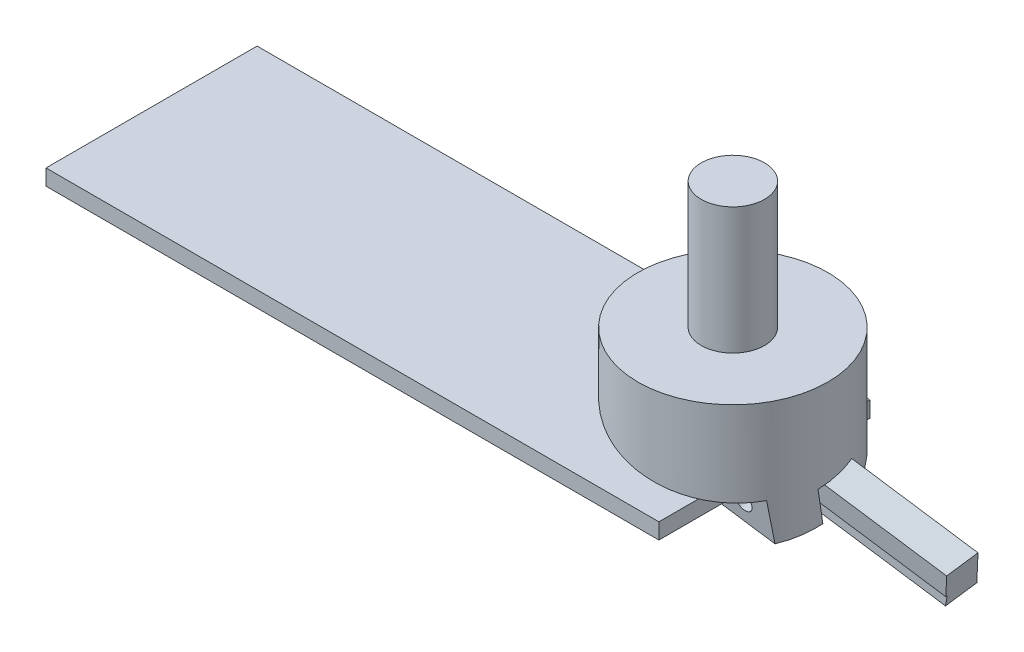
ISO-10303-21;
HEADER;
FILE_DESCRIPTION(('STEP AP214'),'2;1');
FILE_NAME('part.step','',(''),(''),'','','');
FILE_SCHEMA(('AUTOMOTIVE_DESIGN { 1 0 10303 214 1 1 1 1 }'));
ENDSEC;
DATA;
#1=APPLICATION_CONTEXT('core data for automotive mechanical design processes');
#2=APPLICATION_PROTOCOL_DEFINITION('international standard','automotive_design',2000,#1);
#3=PRODUCT_CONTEXT('',#1,'mechanical');
#4=PRODUCT('Part','Part','',(#3));
#5=PRODUCT_RELATED_PRODUCT_CATEGORY('part','',(#4));
#6=PRODUCT_DEFINITION_FORMATION('','',#4);
#7=PRODUCT_DEFINITION_CONTEXT('part definition',#1,'design');
#8=PRODUCT_DEFINITION('design','',#6,#7);
#9=PRODUCT_DEFINITION_SHAPE('','',#8);
#10=(LENGTH_UNIT() NAMED_UNIT(*) SI_UNIT(.MILLI.,.METRE.));
#11=(NAMED_UNIT(*) PLANE_ANGLE_UNIT() SI_UNIT($,.RADIAN.));
#12=(NAMED_UNIT(*) SI_UNIT($,.STERADIAN.) SOLID_ANGLE_UNIT());
#13=UNCERTAINTY_MEASURE_WITH_UNIT(LENGTH_MEASURE(1.E-05),#10,'distance_accuracy_value','');
#14=(GEOMETRIC_REPRESENTATION_CONTEXT(3) GLOBAL_UNCERTAINTY_ASSIGNED_CONTEXT((#13)) GLOBAL_UNIT_ASSIGNED_CONTEXT((#10,
#11,#12)) REPRESENTATION_CONTEXT('',''));
#15=CARTESIAN_POINT('',(0.,0.,0.));
#16=DIRECTION('',(0.,0.,1.));
#17=DIRECTION('',(1.,0.,0.));
#18=AXIS2_PLACEMENT_3D('',#15,#16,#17);
#19=CARTESIAN_POINT('',(67.583925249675,-12.8358584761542,-9.85090724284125));
#20=DIRECTION('',(0.173648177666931,0.975223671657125,0.137058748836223));
#21=DIRECTION('',(-0.984514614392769,0.175302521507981,0.));
#22=AXIS2_PLACEMENT_3D('',#19,#20,#21);
#23=PLANE('',#22);
#24=DIRECTION('',(-0.984807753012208,0.171958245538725,0.0241671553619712));
#25=VECTOR('',#24,1.);
#26=CARTESIAN_POINT('',(67.583925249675,-12.8358584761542,-9.85090724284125));
#27=LINE('',#26,#25);
#28=CARTESIAN_POINT('',(67.583925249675,-12.8358584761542,-9.85090724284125));
#29=VERTEX_POINT('',#28);
#30=CARTESIAN_POINT('',(-30.8968500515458,4.35996607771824,-7.43419170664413));
#31=VERTEX_POINT('',#30);
#32=EDGE_CURVE('E59',#29,#31,#27,.T.);
#33=ORIENTED_EDGE('',*,*,#32,.T.);
#34=DIRECTION('',(0.,0.139173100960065,-0.99026806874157));
#35=VECTOR('',#34,1.);
#36=CARTESIAN_POINT('',(-30.8968500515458,4.35996607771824,-7.43419170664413));
#37=LINE('',#36,#35);
#38=CARTESIAN_POINT('',(-30.8968500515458,2.96823506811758,2.46848898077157));
#39=VERTEX_POINT('',#38);
#40=EDGE_CURVE('E108',#39,#31,#37,.T.);
#41=ORIENTED_EDGE('',*,*,#40,.F.);
#42=DIRECTION('',(-0.984807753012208,0.171958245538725,0.0241671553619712));
#43=VECTOR('',#42,1.);
#44=CARTESIAN_POINT('',(67.583925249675,-14.2275894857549,0.0517734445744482));
#45=LINE('',#44,#43);
#46=CARTESIAN_POINT('',(67.583925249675,-14.2275894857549,0.0517734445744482));
#47=VERTEX_POINT('',#46);
#48=EDGE_CURVE('E12',#47,#39,#45,.T.);
#49=ORIENTED_EDGE('',*,*,#48,.F.);
#50=DIRECTION('',(0.,0.139173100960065,-0.99026806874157));
#51=VECTOR('',#50,1.);
#52=CARTESIAN_POINT('',(67.583925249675,-12.8358584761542,-9.85090724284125));
#53=LINE('',#52,#51);
#54=EDGE_CURVE('E109',#47,#29,#53,.T.);
#55=ORIENTED_EDGE('',*,*,#54,.T.);
#56=EDGE_LOOP('',(#33,#41,#49,#55));
#57=FACE_BOUND('',#56,.T.);
#58=ADVANCED_FACE('F56',(#57),#23,.T.);
#59=CARTESIAN_POINT('',(66.3786775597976,-20.9963681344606,-0.899516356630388));
#60=DIRECTION('',(0.,-0.139173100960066,0.99026806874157));
#61=DIRECTION('',(0.,-0.99026806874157,-0.139173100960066));
#62=AXIS2_PLACEMENT_3D('',#59,#60,#61);
#63=PLANE('',#62);
#64=ORIENTED_EDGE('',*,*,#48,.T.);
#65=DIRECTION('',(0.173648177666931,0.975223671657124,0.137058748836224));
#66=VECTOR('',#65,1.);
#67=CARTESIAN_POINT('',(-32.1020977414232,-3.80054358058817,1.51719917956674));
#68=LINE('',#67,#66);
#69=CARTESIAN_POINT('',(-32.1020977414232,-3.80054358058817,1.51719917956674));
#70=VERTEX_POINT('',#69);
#71=EDGE_CURVE('E126',#70,#39,#68,.T.);
#72=ORIENTED_EDGE('',*,*,#71,.F.);
#73=DIRECTION('',(-0.984807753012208,0.171958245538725,0.0241671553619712));
#74=VECTOR('',#73,1.);
#75=CARTESIAN_POINT('',(66.3786775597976,-20.9963681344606,-0.899516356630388));
#76=LINE('',#75,#74);
#77=CARTESIAN_POINT('',(66.3786775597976,-20.9963681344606,-0.899516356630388));
#78=VERTEX_POINT('',#77);
#79=EDGE_CURVE('E64',#78,#70,#76,.T.);
#80=ORIENTED_EDGE('',*,*,#79,.F.);
#81=DIRECTION('',(0.173648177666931,0.975223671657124,0.137058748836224));
#82=VECTOR('',#81,1.);
#83=CARTESIAN_POINT('',(66.3786775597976,-20.9963681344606,-0.899516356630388));
#84=LINE('',#83,#82);
#85=EDGE_CURVE('E114',#78,#47,#84,.T.);
#86=ORIENTED_EDGE('',*,*,#85,.T.);
#87=EDGE_LOOP('',(#64,#72,#80,#86));
#88=FACE_BOUND('',#87,.T.);
#89=ADVANCED_FACE('F166',(#88),#63,.T.);
#90=CARTESIAN_POINT('',(66.3683880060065,-20.9954766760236,-1.32515710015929));
#91=DIRECTION('',(-0.171958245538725,-0.985102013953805,0.00209377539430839));
#92=DIRECTION('',(0.985104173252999,-0.171958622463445,0.));
#93=AXIS2_PLACEMENT_3D('',#90,#91,#92);
#94=PLANE('',#93);
#95=ORIENTED_EDGE('',*,*,#79,.T.);
#96=DIRECTION('',(0.0241671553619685,-0.00209377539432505,0.999705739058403));
#97=VECTOR('',#96,1.);
#98=CARTESIAN_POINT('',(-32.1123872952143,-3.79965212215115,1.09155843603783));
#99=LINE('',#98,#97);
#100=CARTESIAN_POINT('',(-32.1123872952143,-3.79965212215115,1.09155843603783));
#101=VERTEX_POINT('',#100);
#102=EDGE_CURVE('E133',#101,#70,#99,.T.);
#103=ORIENTED_EDGE('',*,*,#102,.F.);
#104=DIRECTION('',(-0.984807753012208,0.171958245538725,0.0241671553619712));
#105=VECTOR('',#104,1.);
#106=CARTESIAN_POINT('',(66.3683880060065,-20.9954766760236,-1.32515710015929));
#107=LINE('',#106,#105);
#108=CARTESIAN_POINT('',(66.3683880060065,-20.9954766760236,-1.32515710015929));
#109=VERTEX_POINT('',#108);
#110=EDGE_CURVE('E149',#109,#101,#107,.T.);
#111=ORIENTED_EDGE('',*,*,#110,.F.);
#112=DIRECTION('',(0.0241671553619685,-0.00209377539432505,0.999705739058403));
#113=VECTOR('',#112,1.);
#114=CARTESIAN_POINT('',(66.3683880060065,-20.9954766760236,-1.32515710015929));
#115=LINE('',#114,#113);
#116=EDGE_CURVE('E145',#109,#78,#115,.T.);
#117=ORIENTED_EDGE('',*,*,#116,.T.);
#118=EDGE_LOOP('',(#95,#103,#111,#117));
#119=FACE_BOUND('',#118,.T.);
#120=ADVANCED_FACE('F162',(#119),#94,.T.);
#121=CARTESIAN_POINT('',(65.8474434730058,-23.9798262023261,-1.31881404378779));
#122=DIRECTION('',(0.0241671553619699,-0.00209377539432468,0.999705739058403));
#123=DIRECTION('',(0.999707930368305,0.,-0.0241672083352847));
#124=AXIS2_PLACEMENT_3D('',#121,#122,#123);
#125=PLANE('',#124);
#126=ORIENTED_EDGE('',*,*,#110,.T.);
#127=DIRECTION('',(0.171958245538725,0.985102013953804,-0.00209377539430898));
#128=VECTOR('',#127,1.);
#129=CARTESIAN_POINT('',(-32.6333318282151,-6.78400164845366,1.09790149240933));
#130=LINE('',#129,#128);
#131=CARTESIAN_POINT('',(-32.6333318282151,-6.78400164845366,1.09790149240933));
#132=VERTEX_POINT('',#131);
#133=EDGE_CURVE('E130',#132,#101,#130,.T.);
#134=ORIENTED_EDGE('',*,*,#133,.F.);
#135=DIRECTION('',(-0.984807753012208,0.171958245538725,0.0241671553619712));
#136=VECTOR('',#135,1.);
#137=CARTESIAN_POINT('',(65.8474434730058,-23.9798262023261,-1.31881404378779));
#138=LINE('',#137,#136);
#139=CARTESIAN_POINT('',(65.8474434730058,-23.9798262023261,-1.31881404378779));
#140=VERTEX_POINT('',#139);
#141=EDGE_CURVE('E151',#140,#132,#138,.T.);
#142=ORIENTED_EDGE('',*,*,#141,.F.);
#143=DIRECTION('',(0.171958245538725,0.985102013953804,-0.00209377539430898));
#144=VECTOR('',#143,1.);
#145=CARTESIAN_POINT('',(65.8474434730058,-23.9798262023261,-1.31881404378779));
#146=LINE('',#145,#144);
#147=EDGE_CURVE('E142',#140,#109,#146,.T.);
#148=ORIENTED_EDGE('',*,*,#147,.T.);
#149=EDGE_LOOP('',(#126,#134,#142,#148));
#150=FACE_BOUND('',#149,.T.);
#151=ADVANCED_FACE('F159',(#150),#125,.T.);
#152=CARTESIAN_POINT('',(65.8474434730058,-22.5880951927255,-11.2214947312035));
#153=DIRECTION('',(-0.173648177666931,-0.975223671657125,-0.137058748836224));
#154=DIRECTION('',(0.984514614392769,-0.175302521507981,0.));
#155=AXIS2_PLACEMENT_3D('',#152,#153,#154);
#156=PLANE('',#155);
#157=ORIENTED_EDGE('',*,*,#141,.T.);
#158=DIRECTION('',(0.,-0.139173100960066,0.99026806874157));
#159=VECTOR('',#158,1.);
#160=CARTESIAN_POINT('',(-32.6333318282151,-5.392270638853,-8.80477919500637));
#161=LINE('',#160,#159);
#162=CARTESIAN_POINT('',(-32.6333318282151,-5.392270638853,-8.80477919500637));
#163=VERTEX_POINT('',#162);
#164=EDGE_CURVE('E121',#163,#132,#161,.T.);
#165=ORIENTED_EDGE('',*,*,#164,.F.);
#166=DIRECTION('',(-0.984807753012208,0.171958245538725,0.0241671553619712));
#167=VECTOR('',#166,1.);
#168=CARTESIAN_POINT('',(65.8474434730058,-22.5880951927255,-11.2214947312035));
#169=LINE('',#168,#167);
#170=CARTESIAN_POINT('',(65.8474434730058,-22.5880951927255,-11.2214947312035));
#171=VERTEX_POINT('',#170);
#172=EDGE_CURVE('E113',#171,#163,#169,.T.);
#173=ORIENTED_EDGE('',*,*,#172,.F.);
#174=DIRECTION('',(0.,-0.139173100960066,0.99026806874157));
#175=VECTOR('',#174,1.);
#176=CARTESIAN_POINT('',(65.8474434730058,-22.5880951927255,-11.2214947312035));
#177=LINE('',#176,#175);
#178=EDGE_CURVE('E139',#171,#140,#177,.T.);
#179=ORIENTED_EDGE('',*,*,#178,.T.);
#180=EDGE_LOOP('',(#157,#165,#173,#179));
#181=FACE_BOUND('',#180,.T.);
#182=ADVANCED_FACE('F153',(#181),#156,.T.);
#183=CARTESIAN_POINT('',(67.583925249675,-12.8358584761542,-9.85090724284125));
#184=DIRECTION('',(0.,0.139173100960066,-0.99026806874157));
#185=DIRECTION('',(0.,0.99026806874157,0.139173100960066));
#186=AXIS2_PLACEMENT_3D('',#183,#184,#185);
#187=PLANE('',#186);
#188=ORIENTED_EDGE('',*,*,#172,.T.);
#189=DIRECTION('',(-0.173648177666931,-0.975223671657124,-0.137058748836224));
#190=VECTOR('',#189,1.);
#191=CARTESIAN_POINT('',(-30.8968500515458,4.35996607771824,-7.43419170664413));
#192=LINE('',#191,#190);
#193=EDGE_CURVE('E116',#31,#163,#192,.T.);
#194=ORIENTED_EDGE('',*,*,#193,.F.);
#195=ORIENTED_EDGE('',*,*,#32,.F.);
#196=DIRECTION('',(-0.173648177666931,-0.975223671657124,-0.137058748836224));
#197=VECTOR('',#196,1.);
#198=CARTESIAN_POINT('',(67.583925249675,-12.8358584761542,-9.85090724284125));
#199=LINE('',#198,#197);
#200=EDGE_CURVE('E137',#29,#171,#199,.T.);
#201=ORIENTED_EDGE('',*,*,#200,.T.);
#202=EDGE_LOOP('',(#188,#194,#195,#201));
#203=FACE_BOUND('',#202,.T.);
#204=ADVANCED_FACE('F117',(#203),#187,.T.);
#205=CARTESIAN_POINT('',(67.9541710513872,-11.8655443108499,-1.66759350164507));
#206=DIRECTION('',(-0.984807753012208,0.171958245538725,0.0241671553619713));
#207=DIRECTION('',(-0.172008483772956,-0.985095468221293,0.));
#208=AXIS2_PLACEMENT_3D('',#205,#206,#207);
#209=PLANE('',#208);
#210=ORIENTED_EDGE('',*,*,#54,.F.);
#211=ORIENTED_EDGE('',*,*,#85,.F.);
#212=ORIENTED_EDGE('',*,*,#116,.F.);
#213=ORIENTED_EDGE('',*,*,#147,.F.);
#214=ORIENTED_EDGE('',*,*,#178,.F.);
#215=ORIENTED_EDGE('',*,*,#200,.F.);
#216=EDGE_LOOP('',(#210,#211,#212,#213,#214,#215));
#217=FACE_BOUND('',#216,.T.);
#218=ADVANCED_FACE('F165',(#217),#209,.F.);
#219=CARTESIAN_POINT('',(-30.5266042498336,5.33028024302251,0.749122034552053));
#220=DIRECTION('',(-0.984807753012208,0.171958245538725,0.0241671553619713));
#221=DIRECTION('',(-0.172008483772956,-0.985095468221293,0.));
#222=AXIS2_PLACEMENT_3D('',#219,#220,#221);
#223=PLANE('',#222);
#224=ORIENTED_EDGE('',*,*,#40,.T.);
#225=ORIENTED_EDGE('',*,*,#193,.T.);
#226=ORIENTED_EDGE('',*,*,#164,.T.);
#227=ORIENTED_EDGE('',*,*,#133,.T.);
#228=ORIENTED_EDGE('',*,*,#102,.T.);
#229=ORIENTED_EDGE('',*,*,#71,.T.);
#230=EDGE_LOOP('',(#224,#225,#226,#227,#228,#229));
#231=FACE_BOUND('',#230,.T.);
#232=ADVANCED_FACE('F124',(#231),#223,.T.);
#233=CLOSED_SHELL('',(#58,#89,#120,#151,#182,#204,#218,#232));
#234=MANIFOLD_SOLID_BREP('B2',#233);
#235=CARTESIAN_POINT('',(54.2890205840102,-12.1844993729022,2.3585661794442));
#236=DIRECTION('',(0.,-0.139173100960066,0.99026806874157));
#237=DIRECTION('',(0.,-0.99026806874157,-0.139173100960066));
#238=AXIS2_PLACEMENT_3D('',#235,#236,#237);
#239=PLANE('',#238);
#240=CARTESIAN_POINT('',(0.368092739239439,-6.79149159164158,3.11650399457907));
#241=DIRECTION('',(0.,-0.139173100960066,0.99026806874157));
#242=DIRECTION('',(0.,-0.99026806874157,-0.139173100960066));
#243=AXIS2_PLACEMENT_3D('',#240,#241,#242);
#244=CIRCLE('',#243,2.49999999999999);
#245=CARTESIAN_POINT('',(0.368092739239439,-9.2671617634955,2.76857124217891));
#246=VERTEX_POINT('',#245);
#247=EDGE_CURVE('E422',#246,#246,#244,.F.);
#248=ORIENTED_EDGE('',*,*,#247,.F.);
#249=EDGE_LOOP('',(#248));
#250=FACE_BOUND('',#249,.T.);
#251=DIRECTION('',(0.984807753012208,-0.171958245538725,-0.0241671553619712));
#252=VECTOR('',#251,1.);
#253=CARTESIAN_POINT('',(31.1318928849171,-18.1964561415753,1.51364075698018));
#254=LINE('',#253,#252);
#255=CARTESIAN_POINT('',(-29.8486062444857,-7.5485915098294,3.01010054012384));
#256=VERTEX_POINT('',#255);
#257=CARTESIAN_POINT('',(29.9603242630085,-17.9918873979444,1.54239101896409));
#258=VERTEX_POINT('',#257);
#259=EDGE_CURVE('E330',#256,#258,#254,.T.);
#260=ORIENTED_EDGE('',*,*,#259,.F.);
#261=CARTESIAN_POINT('',(0.,-28.9665697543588,0.));
#262=DIRECTION('',(0.,-0.139173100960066,0.99026806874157));
#263=DIRECTION('',(0.,-0.99026806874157,-0.139173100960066));
#264=AXIS2_PLACEMENT_3D('',#261,#262,#263);
#265=ELLIPSE('',#264,215.558896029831,30.);
#266=CARTESIAN_POINT('',(-29.6727579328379,2.47614894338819,4.41898593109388));
#267=VERTEX_POINT('',#266);
#268=EDGE_CURVE('E314',#267,#256,#265,.T.);
#269=ORIENTED_EDGE('',*,*,#268,.F.);
#270=DIRECTION('',(-0.984807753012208,0.171958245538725,0.0241671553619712));
#271=VECTOR('',#270,1.);
#272=CARTESIAN_POINT('',(54.2890205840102,-12.1844993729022,2.3585661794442));
#273=LINE('',#272,#271);
#274=CARTESIAN_POINT('',(29.8537940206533,-7.9178405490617,2.95820597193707));
#275=VERTEX_POINT('',#274);
#276=EDGE_CURVE('E347',#275,#267,#273,.T.);
#277=ORIENTED_EDGE('',*,*,#276,.F.);
#278=EDGE_CURVE('E322',#258,#275,#265,.T.);
#279=ORIENTED_EDGE('',*,*,#278,.F.);
#280=EDGE_LOOP('',(#260,#269,#277,#279));
#281=FACE_BOUND('',#280,.T.);
#282=CARTESIAN_POINT('',(18.0946322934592,-9.88674001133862,2.68149519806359));
#283=DIRECTION('',(0.,-0.139173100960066,0.99026806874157));
#284=DIRECTION('',(0.,-0.99026806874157,-0.139173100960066));
#285=AXIS2_PLACEMENT_3D('',#282,#283,#284);
#286=CIRCLE('',#285,2.49999999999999);
#287=CARTESIAN_POINT('',(18.0946322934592,-12.3624101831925,2.33356244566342));
#288=VERTEX_POINT('',#287);
#289=EDGE_CURVE('E309',#288,#288,#286,.F.);
#290=ORIENTED_EDGE('',*,*,#289,.F.);
#291=EDGE_LOOP('',(#290));
#292=FACE_BOUND('',#291,.T.);
#293=CARTESIAN_POINT('',(-17.3584468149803,-3.69624317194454,3.55151279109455));
#294=DIRECTION('',(0.,-0.139173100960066,0.99026806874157));
#295=DIRECTION('',(0.,-0.99026806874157,-0.139173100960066));
#296=AXIS2_PLACEMENT_3D('',#293,#294,#295);
#297=CIRCLE('',#296,2.49999999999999);
#298=CARTESIAN_POINT('',(-17.3584468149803,-6.17191334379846,3.20358003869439));
#299=VERTEX_POINT('',#298);
#300=EDGE_CURVE('E413',#299,#299,#297,.F.);
#301=ORIENTED_EDGE('',*,*,#300,.F.);
#302=EDGE_LOOP('',(#301));
#303=FACE_BOUND('',#302,.T.);
#304=ADVANCED_FACE('F241',(#250,#281,#292,#303),#239,.F.);
#305=CARTESIAN_POINT('',(31.1318928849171,-9.99026837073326,-56.8764192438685));
#306=DIRECTION('',(0.173648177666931,0.975223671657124,0.137058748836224));
#307=DIRECTION('',(-0.984514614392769,0.175302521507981,0.));
#308=AXIS2_PLACEMENT_3D('',#305,#306,#307);
#309=PLANE('',#308);
#310=CARTESIAN_POINT('',(0.,-12.440387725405,0.));
#311=DIRECTION('',(0.173648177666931,0.975223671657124,0.137058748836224));
#312=DIRECTION('',(0.765504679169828,-0.221221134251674,0.604205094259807));
#313=AXIS2_PLACEMENT_3D('',#310,#311,#312);
#314=ELLIPSE('',#313,30.7621737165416,30.);
#315=CARTESIAN_POINT('',(26.7891285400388,-19.1082390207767,13.5034289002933));
#316=VERTEX_POINT('',#315);
#317=EDGE_CURVE('E307',#316,#258,#314,.T.);
#318=ORIENTED_EDGE('',*,*,#317,.F.);
#319=DIRECTION('',(0.984807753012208,-0.171958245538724,-0.0241671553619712));
#320=VECTOR('',#319,1.);
#321=CARTESIAN_POINT('',(-38.338623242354,-7.73621854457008,15.1016621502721));
#322=LINE('',#321,#320);
#323=CARTESIAN_POINT('',(-26.0945339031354,-9.8741709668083,14.8011925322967));
#324=VERTEX_POINT('',#323);
#325=EDGE_CURVE('E296',#324,#316,#322,.T.);
#326=ORIENTED_EDGE('',*,*,#325,.F.);
#327=EDGE_CURVE('E306',#256,#324,#314,.T.);
#328=ORIENTED_EDGE('',*,*,#327,.F.);
#329=ORIENTED_EDGE('',*,*,#259,.T.);
#330=EDGE_LOOP('',(#318,#326,#328,#329));
#331=FACE_BOUND('',#330,.T.);
#332=ADVANCED_FACE('F304',(#331),#309,.F.);
#333=CARTESIAN_POINT('',(0.,60.,0.));
#334=DIRECTION('',(0.,-1.,0.));
#335=DIRECTION('',(0.,0.,-1.));
#336=AXIS2_PLACEMENT_3D('',#333,#334,#335);
#337=CYLINDRICAL_SURFACE('',#336,30.);
#338=ORIENTED_EDGE('',*,*,#327,.T.);
#339=CARTESIAN_POINT('',(0.,-115.190128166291,0.));
#340=DIRECTION('',(0.,0.139173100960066,-0.99026806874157));
#341=DIRECTION('',(0.,-0.99026806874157,-0.139173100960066));
#342=AXIS2_PLACEMENT_3D('',#339,#340,#341);
#343=ELLIPSE('',#342,215.558896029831,30.);
#344=CARTESIAN_POINT('',(-25.0733736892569,2.01405784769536,16.4719741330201));
#345=VERTEX_POINT('',#344);
#346=EDGE_CURVE('E54',#324,#345,#343,.T.);
#347=ORIENTED_EDGE('',*,*,#346,.T.);
#348=CARTESIAN_POINT('',(0.,-0.1355182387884,0.));
#349=DIRECTION('',(0.173648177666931,0.975223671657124,0.137058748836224));
#350=DIRECTION('',(0.765504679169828,-0.221221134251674,0.604205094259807));
#351=AXIS2_PLACEMENT_3D('',#348,#349,#350);
#352=ELLIPSE('',#351,30.7621737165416,30.);
#353=CARTESIAN_POINT('',(25.8511500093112,-6.8779230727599,15.2222877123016));
#354=VERTEX_POINT('',#353);
#355=EDGE_CURVE('E337',#345,#354,#352,.T.);
#356=ORIENTED_EDGE('',*,*,#355,.T.);
#357=EDGE_CURVE('E245',#354,#316,#343,.T.);
#358=ORIENTED_EDGE('',*,*,#357,.T.);
#359=ORIENTED_EDGE('',*,*,#317,.T.);
#360=ORIENTED_EDGE('',*,*,#278,.T.);
#361=CARTESIAN_POINT('',(0.,-2.18632981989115,0.));
#362=DIRECTION('',(0.173648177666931,0.975223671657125,0.137058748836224));
#363=DIRECTION('',(0.765504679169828,-0.221221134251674,0.604205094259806));
#364=AXIS2_PLACEMENT_3D('',#361,#362,#363);
#365=ELLIPSE('',#364,30.7621737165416,30.);
#366=CARTESIAN_POINT('',(28.6508333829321,-6.03771320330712,-8.8954902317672));
#367=VERTEX_POINT('',#366);
#368=EDGE_CURVE('E333',#275,#367,#365,.T.);
#369=ORIENTED_EDGE('',*,*,#368,.T.);
#370=CARTESIAN_POINT('',(0.,57.2569886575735,0.));
#371=DIRECTION('',(0.,0.139173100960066,-0.99026806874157));
#372=DIRECTION('',(0.,-0.99026806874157,-0.139173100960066));
#373=AXIS2_PLACEMENT_3D('',#370,#371,#372);
#374=ELLIPSE('',#373,215.558896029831,30.);
#375=CARTESIAN_POINT('',(28.177477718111,-16.0105056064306,-10.2970748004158));
#376=VERTEX_POINT('',#375);
#377=EDGE_CURVE('E350',#367,#376,#374,.T.);
#378=ORIENTED_EDGE('',*,*,#377,.T.);
#379=CARTESIAN_POINT('',(-28.6486363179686,-6.08804222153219,-8.90256351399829));
#380=VERTEX_POINT('',#379);
#381=EDGE_CURVE('E316',#376,#380,#314,.T.);
#382=ORIENTED_EDGE('',*,*,#381,.T.);
#383=CARTESIAN_POINT('',(-29.0526739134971,4.03795267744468,-7.47944773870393));
#384=VERTEX_POINT('',#383);
#385=EDGE_CURVE('E264',#380,#384,#374,.T.);
#386=ORIENTED_EDGE('',*,*,#385,.T.);
#387=EDGE_CURVE('E336',#384,#267,#365,.T.);
#388=ORIENTED_EDGE('',*,*,#387,.T.);
#389=ORIENTED_EDGE('',*,*,#268,.T.);
#390=EDGE_LOOP('',(#338,#347,#356,#358,#359,#360,#369,#378,#382,#386,#388,#389));
#391=FACE_BOUND('',#390,.T.);
#392=CARTESIAN_POINT('',(0.,20.,0.));
#393=DIRECTION('',(0.,1.,0.));
#394=DIRECTION('',(0.,0.,1.));
#395=AXIS2_PLACEMENT_3D('',#392,#393,#394);
#396=CIRCLE('',#395,30.);
#397=CARTESIAN_POINT('',(0.,20.,30.));
#398=VERTEX_POINT('',#397);
#399=EDGE_CURVE('E325',#398,#398,#396,.T.);
#400=ORIENTED_EDGE('',*,*,#399,.F.);
#401=EDGE_LOOP('',(#400));
#402=FACE_BOUND('',#401,.T.);
#403=ADVANCED_FACE('F243',(#391,#402),#337,.T.);
#404=CARTESIAN_POINT('',(0.,20.,0.));
#405=DIRECTION('',(0.,1.,0.));
#406=DIRECTION('',(0.,0.,1.));
#407=AXIS2_PLACEMENT_3D('',#404,#405,#406);
#408=PLANE('',#407);
#409=CARTESIAN_POINT('',(0.,20.,0.));
#410=DIRECTION('',(0.,1.,0.));
#411=DIRECTION('',(0.,0.,1.));
#412=AXIS2_PLACEMENT_3D('',#409,#410,#411);
#413=CIRCLE('',#412,10.);
#414=CARTESIAN_POINT('',(0.,20.,10.));
#415=VERTEX_POINT('',#414);
#416=EDGE_CURVE('E362',#415,#415,#413,.T.);
#417=ORIENTED_EDGE('',*,*,#416,.F.);
#418=EDGE_LOOP('',(#417));
#419=FACE_BOUND('',#418,.T.);
#420=ORIENTED_EDGE('',*,*,#399,.T.);
#421=EDGE_LOOP('',(#420));
#422=FACE_BOUND('',#421,.T.);
#423=ADVANCED_FACE('F373',(#419,#422),#408,.T.);
#424=CARTESIAN_POINT('',(0.,20.,0.));
#425=DIRECTION('',(0.,1.,0.));
#426=DIRECTION('',(0.,0.,1.));
#427=AXIS2_PLACEMENT_3D('',#424,#425,#426);
#428=CYLINDRICAL_SURFACE('',#427,10.);
#429=ORIENTED_EDGE('',*,*,#416,.T.);
#430=EDGE_LOOP('',(#429));
#431=FACE_BOUND('',#430,.T.);
#432=CARTESIAN_POINT('',(0.,60.,0.));
#433=DIRECTION('',(0.,1.,0.));
#434=DIRECTION('',(0.,0.,1.));
#435=AXIS2_PLACEMENT_3D('',#432,#433,#434);
#436=CIRCLE('',#435,10.);
#437=CARTESIAN_POINT('',(0.,60.,10.));
#438=VERTEX_POINT('',#437);
#439=EDGE_CURVE('E321',#438,#438,#436,.T.);
#440=ORIENTED_EDGE('',*,*,#439,.F.);
#441=EDGE_LOOP('',(#440));
#442=FACE_BOUND('',#441,.T.);
#443=ADVANCED_FACE('F371',(#431,#442),#428,.T.);
#444=CARTESIAN_POINT('',(0.,60.,0.));
#445=DIRECTION('',(0.,1.,0.));
#446=DIRECTION('',(0.,0.,1.));
#447=AXIS2_PLACEMENT_3D('',#444,#445,#446);
#448=PLANE('',#447);
#449=ORIENTED_EDGE('',*,*,#439,.T.);
#450=EDGE_LOOP('',(#449));
#451=FACE_BOUND('',#450,.T.);
#452=ADVANCED_FACE('F369',(#451),#448,.T.);
#453=ORIENTED_EDGE('',*,*,#381,.F.);
#454=DIRECTION('',(-0.984807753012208,0.171958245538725,0.0241671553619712));
#455=VECTOR('',#454,1.);
#456=CARTESIAN_POINT('',(31.1318928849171,-16.5263789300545,-10.3695760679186));
#457=LINE('',#456,#455);
#458=EDGE_CURVE('E327',#376,#380,#457,.T.);
#459=ORIENTED_EDGE('',*,*,#458,.T.);
#460=EDGE_LOOP('',(#453,#459));
#461=FACE_BOUND('',#460,.T.);
#462=ADVANCED_FACE('F380',(#461),#309,.F.);
#463=CARTESIAN_POINT('',(54.2890205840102,-12.1844993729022,2.3585661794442));
#464=DIRECTION('',(0.173648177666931,0.975223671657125,0.137058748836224));
#465=DIRECTION('',(-0.98451461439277,0.175302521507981,0.));
#466=AXIS2_PLACEMENT_3D('',#463,#464,#465);
#467=PLANE('',#466);
#468=ORIENTED_EDGE('',*,*,#276,.T.);
#469=ORIENTED_EDGE('',*,*,#387,.F.);
#470=DIRECTION('',(-0.984807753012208,0.171958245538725,0.0241671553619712));
#471=VECTOR('',#470,1.);
#472=CARTESIAN_POINT('',(54.2890205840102,-10.5144221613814,-9.52465064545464));
#473=LINE('',#472,#471);
#474=EDGE_CURVE('E345',#367,#384,#473,.T.);
#475=ORIENTED_EDGE('',*,*,#474,.F.);
#476=ORIENTED_EDGE('',*,*,#368,.F.);
#477=EDGE_LOOP('',(#468,#469,#475,#476));
#478=FACE_BOUND('',#477,.T.);
#479=ADVANCED_FACE('F344',(#478),#467,.F.);
#480=CARTESIAN_POINT('',(54.2890205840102,-10.5144221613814,-9.52465064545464));
#481=DIRECTION('',(0.,0.139173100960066,-0.99026806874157));
#482=DIRECTION('',(0.,0.99026806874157,0.139173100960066));
#483=AXIS2_PLACEMENT_3D('',#480,#481,#482);
#484=PLANE('',#483);
#485=ORIENTED_EDGE('',*,*,#458,.F.);
#486=ORIENTED_EDGE('',*,*,#377,.F.);
#487=ORIENTED_EDGE('',*,*,#474,.T.);
#488=ORIENTED_EDGE('',*,*,#385,.F.);
#489=EDGE_LOOP('',(#485,#486,#487,#488));
#490=FACE_BOUND('',#489,.T.);
#491=ADVANCED_FACE('F348',(#490),#484,.F.);
#492=CARTESIAN_POINT('',(-36.2548451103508,3.96646551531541,16.7463671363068));
#493=DIRECTION('',(0.,0.139173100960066,-0.99026806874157));
#494=DIRECTION('',(0.,0.99026806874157,0.139173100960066));
#495=AXIS2_PLACEMENT_3D('',#492,#493,#494);
#496=PLANE('',#495);
#497=CARTESIAN_POINT('',(-17.3584468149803,-5.36632038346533,15.4347296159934));
#498=DIRECTION('',(0.,-0.139173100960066,0.99026806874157));
#499=DIRECTION('',(0.,-0.99026806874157,-0.139173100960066));
#500=AXIS2_PLACEMENT_3D('',#497,#498,#499);
#501=CIRCLE('',#500,2.49999999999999);
#502=CARTESIAN_POINT('',(-17.3584468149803,-7.84199055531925,15.0867968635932));
#503=VERTEX_POINT('',#502);
#504=EDGE_CURVE('E417',#503,#503,#501,.T.);
#505=ORIENTED_EDGE('',*,*,#504,.F.);
#506=EDGE_LOOP('',(#505));
#507=FACE_BOUND('',#506,.T.);
#508=CARTESIAN_POINT('',(0.368092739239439,-8.46156880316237,14.9997208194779));
#509=DIRECTION('',(0.,-0.139173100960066,0.99026806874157));
#510=DIRECTION('',(0.,-0.99026806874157,-0.139173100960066));
#511=AXIS2_PLACEMENT_3D('',#508,#509,#510);
#512=CIRCLE('',#511,2.49999999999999);
#513=CARTESIAN_POINT('',(0.368092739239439,-10.9372389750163,14.6517880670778));
#514=VERTEX_POINT('',#513);
#515=EDGE_CURVE('E416',#514,#514,#512,.T.);
#516=ORIENTED_EDGE('',*,*,#515,.F.);
#517=EDGE_LOOP('',(#516));
#518=FACE_BOUND('',#517,.T.);
#519=CARTESIAN_POINT('',(18.0946322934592,-11.5568172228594,14.5647120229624));
#520=DIRECTION('',(0.,-0.139173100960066,0.99026806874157));
#521=DIRECTION('',(0.,-0.99026806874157,-0.139173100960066));
#522=AXIS2_PLACEMENT_3D('',#519,#520,#521);
#523=CIRCLE('',#522,2.49999999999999);
#524=CARTESIAN_POINT('',(18.0946322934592,-14.0324873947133,14.2167792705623));
#525=VERTEX_POINT('',#524);
#526=EDGE_CURVE('E429',#525,#525,#523,.T.);
#527=ORIENTED_EDGE('',*,*,#526,.F.);
#528=EDGE_LOOP('',(#527));
#529=FACE_BOUND('',#528,.T.);
#530=ORIENTED_EDGE('',*,*,#325,.T.);
#531=ORIENTED_EDGE('',*,*,#357,.F.);
#532=DIRECTION('',(0.984807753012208,-0.171958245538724,-0.0241671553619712));
#533=VECTOR('',#532,1.);
#534=CARTESIAN_POINT('',(-36.2548451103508,3.96646551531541,16.7463671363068));
#535=LINE('',#534,#533);
#536=EDGE_CURVE('E256',#345,#354,#535,.T.);
#537=ORIENTED_EDGE('',*,*,#536,.F.);
#538=ORIENTED_EDGE('',*,*,#346,.F.);
#539=EDGE_LOOP('',(#530,#531,#537,#538));
#540=FACE_BOUND('',#539,.T.);
#541=ADVANCED_FACE('F295',(#507,#518,#529,#540),#496,.F.);
#542=CARTESIAN_POINT('',(-0.0229494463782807,-0.128886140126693,-0.0181137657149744));
#543=DIRECTION('',(0.173648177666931,0.975223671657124,0.137058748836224));
#544=DIRECTION('',(-0.98451461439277,0.175302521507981,0.));
#545=AXIS2_PLACEMENT_3D('',#542,#543,#544);
#546=PLANE('',#545);
#547=ORIENTED_EDGE('',*,*,#536,.T.);
#548=ORIENTED_EDGE('',*,*,#355,.F.);
#549=EDGE_LOOP('',(#547,#548));
#550=FACE_BOUND('',#549,.T.);
#551=ADVANCED_FACE('F440',(#550),#546,.F.);
#552=CARTESIAN_POINT('',(18.0946322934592,-11.5568172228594,14.5647120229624));
#553=DIRECTION('',(0.,-0.139173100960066,0.99026806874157));
#554=DIRECTION('',(0.,-0.99026806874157,-0.139173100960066));
#555=AXIS2_PLACEMENT_3D('',#552,#553,#554);
#556=CYLINDRICAL_SURFACE('',#555,2.49999999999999);
#557=ORIENTED_EDGE('',*,*,#289,.T.);
#558=EDGE_LOOP('',(#557));
#559=FACE_BOUND('',#558,.T.);
#560=ORIENTED_EDGE('',*,*,#526,.T.);
#561=EDGE_LOOP('',(#560));
#562=FACE_BOUND('',#561,.T.);
#563=ADVANCED_FACE('F437',(#559,#562),#556,.F.);
#564=CARTESIAN_POINT('',(0.368092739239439,-8.46156880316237,14.9997208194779));
#565=DIRECTION('',(0.,-0.139173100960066,0.99026806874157));
#566=DIRECTION('',(0.,-0.99026806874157,-0.139173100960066));
#567=AXIS2_PLACEMENT_3D('',#564,#565,#566);
#568=CYLINDRICAL_SURFACE('',#567,2.49999999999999);
#569=ORIENTED_EDGE('',*,*,#247,.T.);
#570=EDGE_LOOP('',(#569));
#571=FACE_BOUND('',#570,.T.);
#572=ORIENTED_EDGE('',*,*,#515,.T.);
#573=EDGE_LOOP('',(#572));
#574=FACE_BOUND('',#573,.T.);
#575=ADVANCED_FACE('F449',(#571,#574),#568,.F.);
#576=CARTESIAN_POINT('',(-17.3584468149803,-5.36632038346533,15.4347296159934));
#577=DIRECTION('',(0.,-0.139173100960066,0.99026806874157));
#578=DIRECTION('',(0.,-0.99026806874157,-0.139173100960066));
#579=AXIS2_PLACEMENT_3D('',#576,#577,#578);
#580=CYLINDRICAL_SURFACE('',#579,2.49999999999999);
#581=ORIENTED_EDGE('',*,*,#300,.T.);
#582=EDGE_LOOP('',(#581));
#583=FACE_BOUND('',#582,.T.);
#584=ORIENTED_EDGE('',*,*,#504,.T.);
#585=EDGE_LOOP('',(#584));
#586=FACE_BOUND('',#585,.T.);
#587=ADVANCED_FACE('F451',(#583,#586),#580,.F.);
#588=CLOSED_SHELL('',(#304,#332,#403,#423,#443,#452,#462,#479,#491,#541,#551,#563,#575,#587));
#589=MANIFOLD_SOLID_BREP('B6',#588);
#590=CARTESIAN_POINT('',(11.5365436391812,-15.,34.9080318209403));
#591=DIRECTION('',(1.,0.,0.));
#592=DIRECTION('',(0.,0.,-1.));
#593=AXIS2_PLACEMENT_3D('',#590,#591,#592);
#594=PLANE('',#593);
#595=DIRECTION('',(0.,0.,-1.));
#596=VECTOR('',#595,1.);
#597=CARTESIAN_POINT('',(11.5365436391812,-10.,34.9080318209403));
#598=LINE('',#597,#596);
#599=CARTESIAN_POINT('',(11.5365436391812,-10.,34.9080318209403));
#600=VERTEX_POINT('',#599);
#601=CARTESIAN_POINT('',(11.5365436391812,-10.,-31.7779336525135));
#602=VERTEX_POINT('',#601);
#603=EDGE_CURVE('E646',#600,#602,#598,.T.);
#604=ORIENTED_EDGE('',*,*,#603,.F.);
#605=DIRECTION('',(0.,1.,0.));
#606=VECTOR('',#605,1.);
#607=CARTESIAN_POINT('',(11.5365436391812,-15.,34.9080318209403));
#608=LINE('',#607,#606);
#609=CARTESIAN_POINT('',(11.5365436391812,-15.,34.9080318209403));
#610=VERTEX_POINT('',#609);
#611=EDGE_CURVE('E239',#610,#600,#608,.T.);
#612=ORIENTED_EDGE('',*,*,#611,.F.);
#613=DIRECTION('',(0.,0.,-1.));
#614=VECTOR('',#613,1.);
#615=CARTESIAN_POINT('',(11.5365436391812,-15.,34.9080318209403));
#616=LINE('',#615,#614);
#617=CARTESIAN_POINT('',(11.5365436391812,-15.,-31.7779336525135));
#618=VERTEX_POINT('',#617);
#619=EDGE_CURVE('E640',#610,#618,#616,.T.);
#620=ORIENTED_EDGE('',*,*,#619,.T.);
#621=DIRECTION('',(0.,1.,0.));
#622=VECTOR('',#621,1.);
#623=CARTESIAN_POINT('',(11.5365436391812,-15.,-31.7779336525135));
#624=LINE('',#623,#622);
#625=EDGE_CURVE('E585',#618,#602,#624,.T.);
#626=ORIENTED_EDGE('',*,*,#625,.T.);
#627=EDGE_LOOP('',(#604,#612,#620,#626));
#628=FACE_BOUND('',#627,.T.);
#629=ADVANCED_FACE('F582',(#628),#594,.T.);
#630=CARTESIAN_POINT('',(-182.098464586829,-15.,34.9080318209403));
#631=DIRECTION('',(0.,0.,1.));
#632=DIRECTION('',(1.,0.,0.));
#633=AXIS2_PLACEMENT_3D('',#630,#631,#632);
#634=PLANE('',#633);
#635=DIRECTION('',(1.,0.,0.));
#636=VECTOR('',#635,1.);
#637=CARTESIAN_POINT('',(-182.098464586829,-10.,34.9080318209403));
#638=LINE('',#637,#636);
#639=CARTESIAN_POINT('',(-182.098464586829,-10.,34.9080318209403));
#640=VERTEX_POINT('',#639);
#641=EDGE_CURVE('E642',#640,#600,#638,.T.);
#642=ORIENTED_EDGE('',*,*,#641,.F.);
#643=DIRECTION('',(0.,1.,0.));
#644=VECTOR('',#643,1.);
#645=CARTESIAN_POINT('',(-182.098464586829,-15.,34.9080318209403));
#646=LINE('',#645,#644);
#647=CARTESIAN_POINT('',(-182.098464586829,-15.,34.9080318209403));
#648=VERTEX_POINT('',#647);
#649=EDGE_CURVE('E591',#648,#640,#646,.T.);
#650=ORIENTED_EDGE('',*,*,#649,.F.);
#651=DIRECTION('',(1.,0.,0.));
#652=VECTOR('',#651,1.);
#653=CARTESIAN_POINT('',(-182.098464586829,-15.,34.9080318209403));
#654=LINE('',#653,#652);
#655=EDGE_CURVE('E637',#648,#610,#654,.T.);
#656=ORIENTED_EDGE('',*,*,#655,.T.);
#657=ORIENTED_EDGE('',*,*,#611,.T.);
#658=EDGE_LOOP('',(#642,#650,#656,#657));
#659=FACE_BOUND('',#658,.T.);
#660=ADVANCED_FACE('F656',(#659),#634,.T.);
#661=CARTESIAN_POINT('',(-182.098464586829,-15.,34.9080318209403));
#662=DIRECTION('',(-1.,0.,0.));
#663=DIRECTION('',(0.,0.,1.));
#664=AXIS2_PLACEMENT_3D('',#661,#662,#663);
#665=PLANE('',#664);
#666=DIRECTION('',(0.,0.,1.));
#667=VECTOR('',#666,1.);
#668=CARTESIAN_POINT('',(-182.098464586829,-10.,34.9080318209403));
#669=LINE('',#668,#667);
#670=CARTESIAN_POINT('',(-182.098464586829,-10.,-31.7779336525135));
#671=VERTEX_POINT('',#670);
#672=EDGE_CURVE('E632',#671,#640,#669,.T.);
#673=ORIENTED_EDGE('',*,*,#672,.F.);
#674=DIRECTION('',(0.,1.,0.));
#675=VECTOR('',#674,1.);
#676=CARTESIAN_POINT('',(-182.098464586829,-15.,-31.7779336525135));
#677=LINE('',#676,#675);
#678=CARTESIAN_POINT('',(-182.098464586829,-15.,-31.7779336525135));
#679=VERTEX_POINT('',#678);
#680=EDGE_CURVE('E627',#679,#671,#677,.T.);
#681=ORIENTED_EDGE('',*,*,#680,.F.);
#682=DIRECTION('',(0.,0.,1.));
#683=VECTOR('',#682,1.);
#684=CARTESIAN_POINT('',(-182.098464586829,-15.,34.9080318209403));
#685=LINE('',#684,#683);
#686=EDGE_CURVE('E630',#679,#648,#685,.T.);
#687=ORIENTED_EDGE('',*,*,#686,.T.);
#688=ORIENTED_EDGE('',*,*,#649,.T.);
#689=EDGE_LOOP('',(#673,#681,#687,#688));
#690=FACE_BOUND('',#689,.T.);
#691=ADVANCED_FACE('F629',(#690),#665,.T.);
#692=CARTESIAN_POINT('',(-182.098464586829,-15.,-31.7779336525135));
#693=DIRECTION('',(0.,0.,-1.));
#694=DIRECTION('',(-1.,0.,0.));
#695=AXIS2_PLACEMENT_3D('',#692,#693,#694);
#696=PLANE('',#695);
#697=DIRECTION('',(-1.,0.,0.));
#698=VECTOR('',#697,1.);
#699=CARTESIAN_POINT('',(-182.098464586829,-10.,-31.7779336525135));
#700=LINE('',#699,#698);
#701=EDGE_CURVE('E649',#602,#671,#700,.T.);
#702=ORIENTED_EDGE('',*,*,#701,.F.);
#703=ORIENTED_EDGE('',*,*,#625,.F.);
#704=DIRECTION('',(-1.,0.,0.));
#705=VECTOR('',#704,1.);
#706=CARTESIAN_POINT('',(-182.098464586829,-15.,-31.7779336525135));
#707=LINE('',#706,#705);
#708=EDGE_CURVE('E636',#618,#679,#707,.T.);
#709=ORIENTED_EDGE('',*,*,#708,.T.);
#710=ORIENTED_EDGE('',*,*,#680,.T.);
#711=EDGE_LOOP('',(#702,#703,#709,#710));
#712=FACE_BOUND('',#711,.T.);
#713=ADVANCED_FACE('F639',(#712),#696,.T.);
#714=CARTESIAN_POINT('',(0.,-15.,0.));
#715=DIRECTION('',(0.,-1.,0.));
#716=DIRECTION('',(0.,0.,-1.));
#717=AXIS2_PLACEMENT_3D('',#714,#715,#716);
#718=PLANE('',#717);
#719=ORIENTED_EDGE('',*,*,#619,.F.);
#720=ORIENTED_EDGE('',*,*,#655,.F.);
#721=ORIENTED_EDGE('',*,*,#686,.F.);
#722=ORIENTED_EDGE('',*,*,#708,.F.);
#723=EDGE_LOOP('',(#719,#720,#721,#722));
#724=FACE_BOUND('',#723,.T.);
#725=ADVANCED_FACE('F635',(#724),#718,.T.);
#726=CARTESIAN_POINT('',(0.,-10.,0.));
#727=DIRECTION('',(0.,-1.,0.));
#728=DIRECTION('',(0.,0.,-1.));
#729=AXIS2_PLACEMENT_3D('',#726,#727,#728);
#730=PLANE('',#729);
#731=ORIENTED_EDGE('',*,*,#603,.T.);
#732=ORIENTED_EDGE('',*,*,#701,.T.);
#733=ORIENTED_EDGE('',*,*,#672,.T.);
#734=ORIENTED_EDGE('',*,*,#641,.T.);
#735=EDGE_LOOP('',(#731,#732,#733,#734));
#736=FACE_BOUND('',#735,.T.);
#737=ADVANCED_FACE('F655',(#736),#730,.F.);
#738=CLOSED_SHELL('',(#629,#660,#691,#713,#725,#737));
#739=MANIFOLD_SOLID_BREP('B48_NOT_SHOWN',#738);
#740=ADVANCED_BREP_SHAPE_REPRESENTATION('',(#18,#234,#589,#739),#14);
#741=SHAPE_DEFINITION_REPRESENTATION(#9,#740);
ENDSEC;
END-ISO-10303-21;
